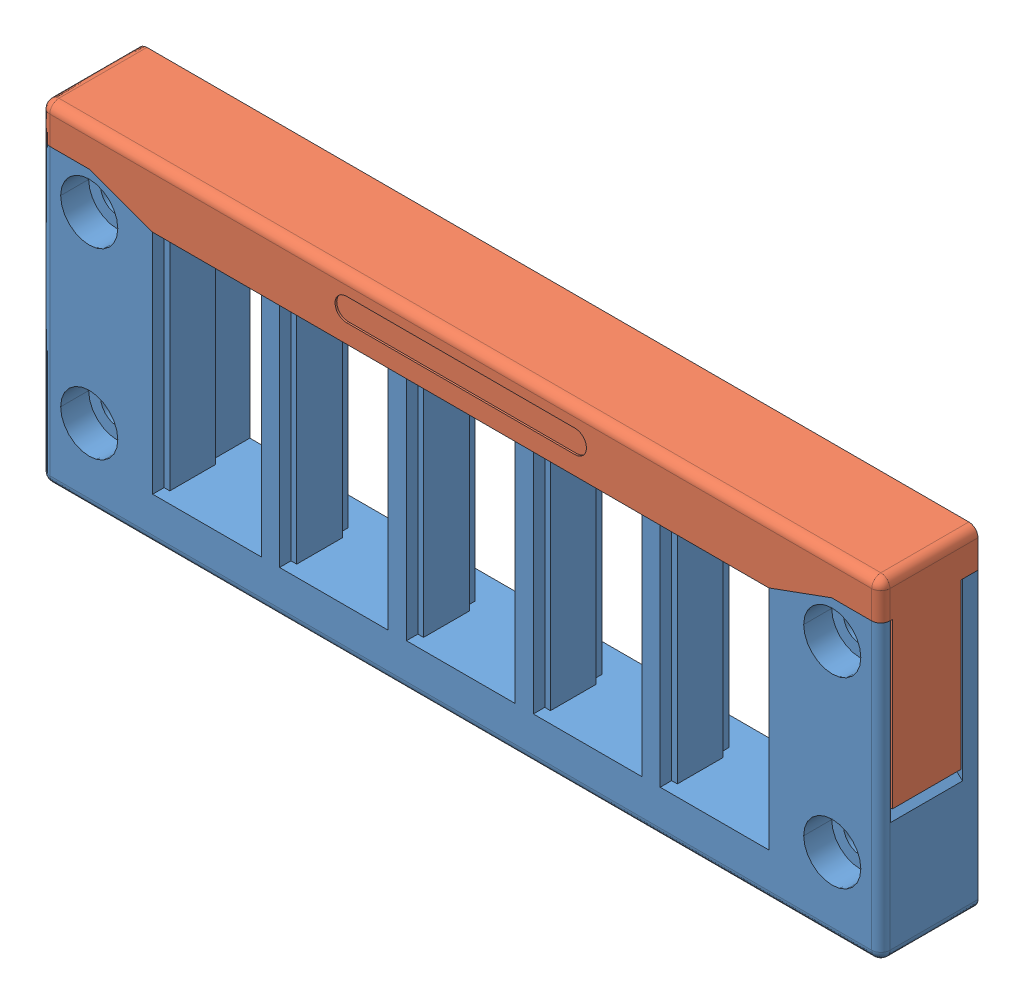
SolidWorks assembly 42410.SLDASM, configuration Default (file format 8000). Lengths in mm.
Overall size (147 58 17).
2 component instances, 2 part files, 0 mates.
Components (placement in the parent):
- 42410_01-1: 42410_01.SLDPRT [Default] at origin size (147 51.5 17)
- 42410_02-1: 42410_02.SLDPRT [Default] at origin size (147 35.2 17)
